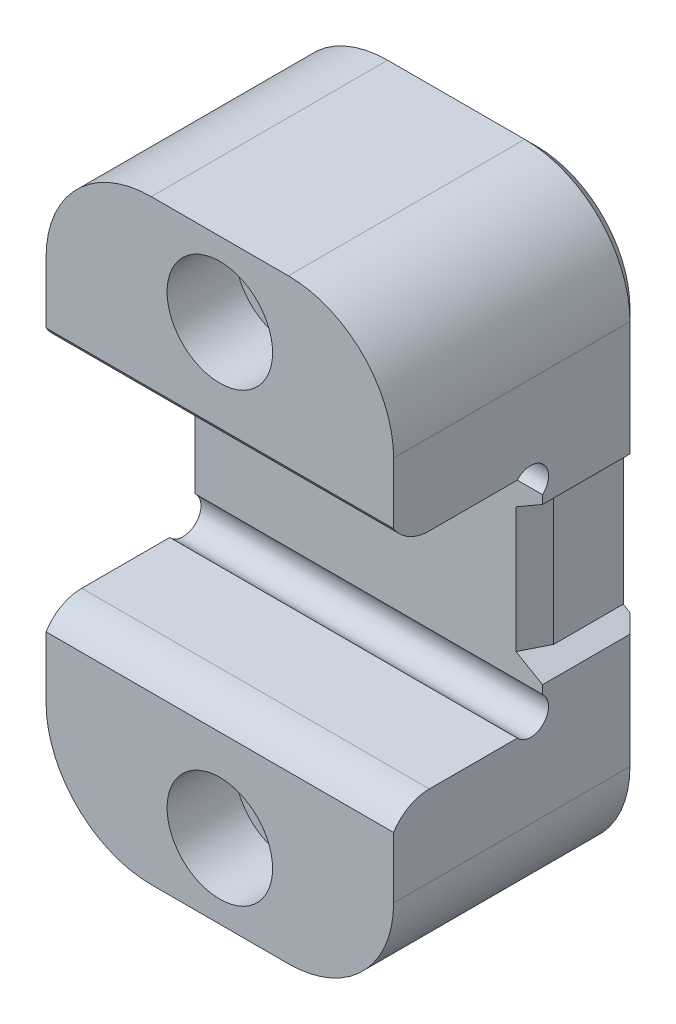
from build123d import *

# Parameters (mm, degrees)
EXTRUDE1_DEPTH              = 22.225
FILLET1_R                   = 13.462
CUT_EXTRUDE1_DEPTH          = 59.887477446
CUT_EXTRUDE2_DEPTH          = 67.599361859
SKETCH6_R                   = 2.286
CUT_EXTRUDE3_DEPTH          = 67.599361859
F_5_16_18_CBORE_D           = 7.9248
F_5_16_18_CBORE_CBORE_D     = 13.49502
F_5_16_18_CBORE_CBORE_DEPTH = 8.73252
F_3_8_16_TAPPED_HOLE1_D     = 8.2042
F_3_8_16_TAPPED_HOLE1_DEPTH = 26.9875
F_3_8_16_TAPPED_HOLE1_TIP   = 2.464790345
CHAMFER3_SIZE               = 3.81
CHAMFER3_SIZE2              = 1.020886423
CHAMFER1_SIZE               = 1.524


with BuildPart() as part:
    # Sketch1 → Extrude1 (new, symmetric)
    with BuildSketch(Plane(origin=(0, 0, 0), x_dir=(0, 0, -1), z_dir=(1, 0, 0))):
        Polygon((0, 14.2875), (19.05, 14.2875), (19.05, -14.2875), (0, -14.2875), (0, -38.1), (31.75, -38.1), (31.75, 38.1), (0, 38.1), align=None)
    extrude(amount=EXTRUDE1_DEPTH, both=True)

    # Fillet1
    fillet1_edges = [part.edges().sort_by_distance(p)[0] for p in [
        (22.225, -38.1, -15.875),
        (22.225, 38.1, -15.875),
        (-22.225, 38.1, -15.875),
        (-22.225, -38.1, -15.875),
    ]]
    fillet(fillet1_edges, radius=FILLET1_R)

    # Sketch2 → Cut-Extrude1 (cut, through all)
    with BuildSketch(Plane(origin=(-9.525, 0, -31.75), x_dir=(1, 0, 0), z_dir=(0, 0, 1))):
        Polygon((29.36875, 8.608456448), (32.54375, 10.441543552), (32.54375, -10.441543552), (29.36875, -8.608456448), align=None)
    extrude(amount=CUT_EXTRUDE1_DEPTH, mode=Mode.SUBTRACT)

    # Sketch5 → Cut-Extrude2 (cut, through all)
    with BuildSketch(Plane(origin=(22.225, 0, 0), x_dir=(0, 0, -1), z_dir=(1, 0, 0))):
        with BuildLine():
            Line((-1.778, -13.6525), (4.572, -13.6525))
            Line((4.572, -13.6525), (4.572, -14.2875))
            ThreePointArc((4.572, -14.2875), (1.956909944, -14.9651379), (0, -16.8275))
            Line((0, -16.8275), (-1.778, -16.8275))
            Line((-1.778, -16.8275), (-1.778, -13.6525))
        make_face()
        with BuildLine():
            Line((4.572, 13.6525), (4.572, 14.2875))
            ThreePointArc((4.572, 14.2875), (1.956909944, 14.9651379), (0, 16.8275))
            Line((0, 16.8275), (-1.778, 16.8275))
            Line((-1.778, 16.8275), (-1.778, 13.6525))
            Line((-1.778, 13.6525), (4.572, 13.6525))
        make_face()
    extrude(amount=-CUT_EXTRUDE2_DEPTH, mode=Mode.SUBTRACT)

    # Sketch6 → Cut-Extrude3 (cut, through all)
    with BuildSketch(Plane(origin=(22.225, 0, 0), x_dir=(0, 0, -1), z_dir=(1, 0, 0))):
        with Locations((17.526, 12.7635)):
            Circle(SKETCH6_R)
        with Locations((17.526, -12.7635)):
            Circle(SKETCH6_R)
    extrude(amount=-CUT_EXTRUDE3_DEPTH, mode=Mode.SUBTRACT)

    # 5_16_-18 CBORE (through all)
    with Locations(Plane.XY):
        with Locations((0, 28.575), (0, -28.575)):
            CounterBoreHole(F_5_16_18_CBORE_D / 2, F_5_16_18_CBORE_CBORE_D / 2, F_5_16_18_CBORE_CBORE_DEPTH)

    # 3_8-16 Tapped Hole1
    with Locations(Plane.XY.offset(-8.73252)):
        with Locations((0, 28.575), (0, -28.575)):
            Hole(F_3_8_16_TAPPED_HOLE1_D / 2, depth=F_3_8_16_TAPPED_HOLE1_DEPTH)
            with Locations((0, 0, -(F_3_8_16_TAPPED_HOLE1_DEPTH + F_3_8_16_TAPPED_HOLE1_TIP / 2))):  # 118° drill point
                Cone(0, F_3_8_16_TAPPED_HOLE1_D / 2, F_3_8_16_TAPPED_HOLE1_TIP, mode=Mode.SUBTRACT)

    # Chamfer3
    chamfer3_edges = [part.edges().sort_by_distance(p)[0] for p in [
        (19.84375, 0, -19.05),
    ]]
    chamfer3_side = [part.faces().sort_by_distance(p)[0] for p in [
        (19.84375, 0, -25.4),
    ]]
    chamfer(chamfer3_edges, length=CHAMFER3_SIZE, length2=CHAMFER3_SIZE2, reference=chamfer3_side[0])

    # Chamfer1
    chamfer1_edges = [part.edges().sort_by_distance(p)[0] for p in [
        (22.225, -17.310635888, -31.75),
        (-22.225, 0, -31.75),
        (0, 38.1, -31.75),
        (0, -38.1, -31.75),
        (-18.282071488, 34.157071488, -31.75),
        (-18.282071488, -34.157071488, -31.75),
        (18.282071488, 34.157071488, -31.75),
        (18.282071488, -34.157071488, -31.75),
        (22.225, 17.310635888, -31.75),
    ]]
    chamfer(chamfer1_edges, length=CHAMFER1_SIZE)


solid = part.part
